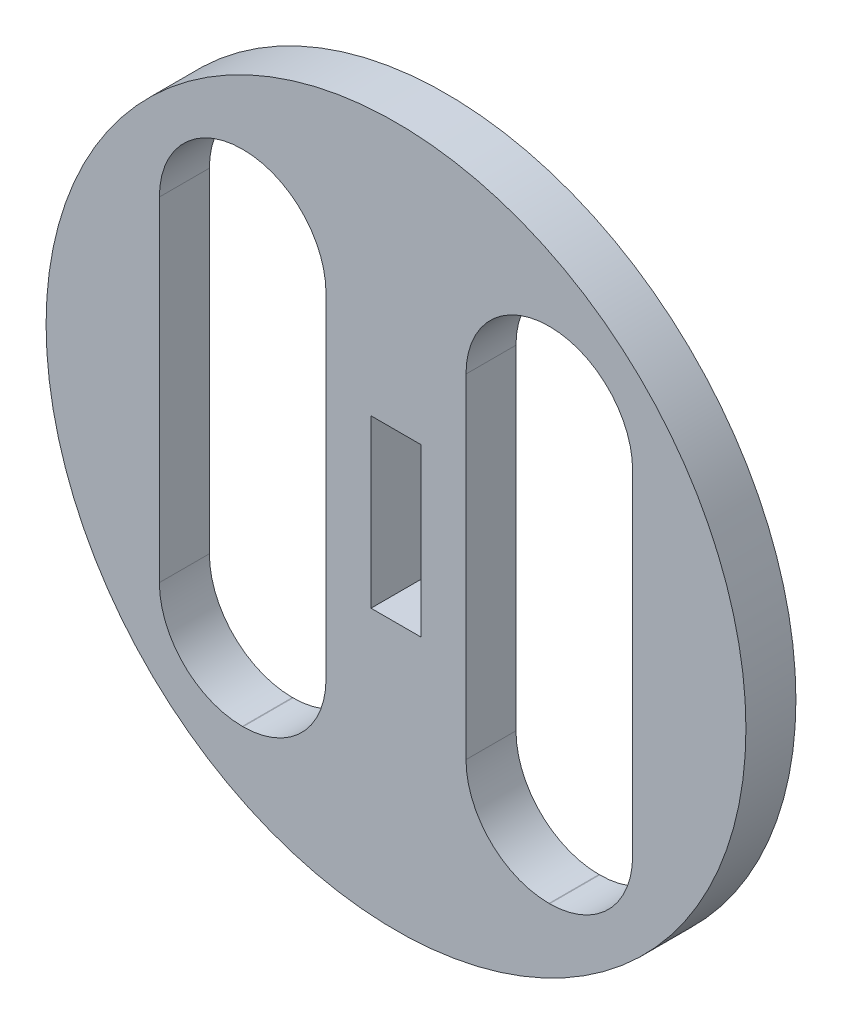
ISO-10303-21;
HEADER;
FILE_DESCRIPTION(('STEP AP214'),'2;1');
FILE_NAME('part.step','',(''),(''),'','','');
FILE_SCHEMA(('AUTOMOTIVE_DESIGN { 1 0 10303 214 1 1 1 1 }'));
ENDSEC;
DATA;
#1=APPLICATION_CONTEXT('core data for automotive mechanical design processes');
#2=APPLICATION_PROTOCOL_DEFINITION('international standard','automotive_design',2000,#1);
#3=PRODUCT_CONTEXT('',#1,'mechanical');
#4=PRODUCT('Part','Part','',(#3));
#5=PRODUCT_RELATED_PRODUCT_CATEGORY('part','',(#4));
#6=PRODUCT_DEFINITION_FORMATION('','',#4);
#7=PRODUCT_DEFINITION_CONTEXT('part definition',#1,'design');
#8=PRODUCT_DEFINITION('design','',#6,#7);
#9=PRODUCT_DEFINITION_SHAPE('','',#8);
#10=(LENGTH_UNIT() NAMED_UNIT(*) SI_UNIT(.MILLI.,.METRE.));
#11=(NAMED_UNIT(*) PLANE_ANGLE_UNIT() SI_UNIT($,.RADIAN.));
#12=(NAMED_UNIT(*) SI_UNIT($,.STERADIAN.) SOLID_ANGLE_UNIT());
#13=UNCERTAINTY_MEASURE_WITH_UNIT(LENGTH_MEASURE(1.E-05),#10,'distance_accuracy_value','');
#14=(GEOMETRIC_REPRESENTATION_CONTEXT(3) GLOBAL_UNCERTAINTY_ASSIGNED_CONTEXT((#13)) GLOBAL_UNIT_ASSIGNED_CONTEXT((#10,
#11,#12)) REPRESENTATION_CONTEXT('',''));
#15=CARTESIAN_POINT('',(0.,0.,0.));
#16=DIRECTION('',(0.,0.,1.));
#17=DIRECTION('',(1.,0.,0.));
#18=AXIS2_PLACEMENT_3D('',#15,#16,#17);
#19=CARTESIAN_POINT('',(0.,0.,3.81));
#20=DIRECTION('',(0.,0.,1.));
#21=DIRECTION('',(1.,0.,0.));
#22=AXIS2_PLACEMENT_3D('',#19,#20,#21);
#23=PLANE('',#22);
#24=DIRECTION('',(0.,-1.,0.));
#25=VECTOR('',#24,1.);
#26=CARTESIAN_POINT('',(5.334,12.7254,3.81));
#27=LINE('',#26,#25);
#28=CARTESIAN_POINT('',(5.334,12.7254,3.81));
#29=VERTEX_POINT('',#28);
#30=CARTESIAN_POINT('',(5.334,-12.7254,3.81));
#31=VERTEX_POINT('',#30);
#32=EDGE_CURVE('E229',#29,#31,#27,.T.);
#33=ORIENTED_EDGE('',*,*,#32,.F.);
#34=CARTESIAN_POINT('',(11.6586,12.7254,3.81));
#35=DIRECTION('',(0.,0.,1.));
#36=DIRECTION('',(-1.,0.,0.));
#37=AXIS2_PLACEMENT_3D('',#34,#35,#36);
#38=CIRCLE('',#37,6.3246);
#39=CARTESIAN_POINT('',(11.6586,19.05,3.81));
#40=VERTEX_POINT('',#39);
#41=EDGE_CURVE('E227',#40,#29,#38,.T.);
#42=ORIENTED_EDGE('',*,*,#41,.F.);
#43=DIRECTION('',(-1.,0.,0.));
#44=VECTOR('',#43,1.);
#45=CARTESIAN_POINT('',(11.6586,19.05,3.81));
#46=LINE('',#45,#44);
#47=CARTESIAN_POINT('',(11.7094,19.05,3.81));
#48=VERTEX_POINT('',#47);
#49=EDGE_CURVE('E242',#48,#40,#46,.T.);
#50=ORIENTED_EDGE('',*,*,#49,.F.);
#51=CARTESIAN_POINT('',(11.7094,12.7254,3.81));
#52=DIRECTION('',(0.,0.,1.));
#53=DIRECTION('',(1.,0.,0.));
#54=AXIS2_PLACEMENT_3D('',#51,#52,#53);
#55=CIRCLE('',#54,6.3246);
#56=CARTESIAN_POINT('',(18.034,12.7254,3.81));
#57=VERTEX_POINT('',#56);
#58=EDGE_CURVE('E239',#57,#48,#55,.T.);
#59=ORIENTED_EDGE('',*,*,#58,.F.);
#60=DIRECTION('',(0.,1.,0.));
#61=VECTOR('',#60,1.);
#62=CARTESIAN_POINT('',(18.034,12.7254,3.81));
#63=LINE('',#62,#61);
#64=CARTESIAN_POINT('',(18.034,-12.7254,3.81));
#65=VERTEX_POINT('',#64);
#66=EDGE_CURVE('E237',#65,#57,#63,.T.);
#67=ORIENTED_EDGE('',*,*,#66,.F.);
#68=CARTESIAN_POINT('',(11.7094,-12.7254,3.81));
#69=DIRECTION('',(0.,0.,1.));
#70=DIRECTION('',(1.,0.,0.));
#71=AXIS2_PLACEMENT_3D('',#68,#69,#70);
#72=CIRCLE('',#71,6.3246);
#73=CARTESIAN_POINT('',(11.7094,-19.05,3.81));
#74=VERTEX_POINT('',#73);
#75=EDGE_CURVE('E235',#74,#65,#72,.T.);
#76=ORIENTED_EDGE('',*,*,#75,.F.);
#77=DIRECTION('',(1.,0.,0.));
#78=VECTOR('',#77,1.);
#79=CARTESIAN_POINT('',(11.6586,-19.05,3.81));
#80=LINE('',#79,#78);
#81=CARTESIAN_POINT('',(11.6586,-19.05,3.81));
#82=VERTEX_POINT('',#81);
#83=EDGE_CURVE('E233',#82,#74,#80,.T.);
#84=ORIENTED_EDGE('',*,*,#83,.F.);
#85=CARTESIAN_POINT('',(11.6586,-12.7254,3.81));
#86=DIRECTION('',(0.,0.,1.));
#87=DIRECTION('',(1.,0.,0.));
#88=AXIS2_PLACEMENT_3D('',#85,#86,#87);
#89=CIRCLE('',#88,6.3246);
#90=EDGE_CURVE('E231',#31,#82,#89,.T.);
#91=ORIENTED_EDGE('',*,*,#90,.F.);
#92=EDGE_LOOP('',(#33,#42,#50,#59,#67,#76,#84,#91));
#93=FACE_BOUND('',#92,.T.);
#94=CARTESIAN_POINT('',(0.,0.,3.81));
#95=DIRECTION('',(0.,0.,1.));
#96=DIRECTION('',(1.,0.,0.));
#97=AXIS2_PLACEMENT_3D('',#94,#95,#96);
#98=CIRCLE('',#97,26.67);
#99=CARTESIAN_POINT('',(-26.67,0.,3.81));
#100=VERTEX_POINT('',#99);
#101=EDGE_CURVE('E11',#100,#100,#98,.T.);
#102=ORIENTED_EDGE('',*,*,#101,.T.);
#103=EDGE_LOOP('',(#102));
#104=FACE_BOUND('',#103,.T.);
#105=DIRECTION('',(0.,-1.,0.));
#106=VECTOR('',#105,1.);
#107=CARTESIAN_POINT('',(-18.034,12.7254,3.81));
#108=LINE('',#107,#106);
#109=CARTESIAN_POINT('',(-18.034,12.7254,3.81));
#110=VERTEX_POINT('',#109);
#111=CARTESIAN_POINT('',(-18.034,-12.7254,3.81));
#112=VERTEX_POINT('',#111);
#113=EDGE_CURVE('E288',#110,#112,#108,.T.);
#114=ORIENTED_EDGE('',*,*,#113,.F.);
#115=CARTESIAN_POINT('',(-11.7094,12.7254,3.81));
#116=DIRECTION('',(0.,0.,1.));
#117=DIRECTION('',(-1.,0.,0.));
#118=AXIS2_PLACEMENT_3D('',#115,#116,#117);
#119=CIRCLE('',#118,6.3246);
#120=CARTESIAN_POINT('',(-11.7094,19.05,3.81));
#121=VERTEX_POINT('',#120);
#122=EDGE_CURVE('E286',#121,#110,#119,.T.);
#123=ORIENTED_EDGE('',*,*,#122,.F.);
#124=DIRECTION('',(-1.,0.,0.));
#125=VECTOR('',#124,1.);
#126=CARTESIAN_POINT('',(-11.7094,19.05,3.81));
#127=LINE('',#126,#125);
#128=CARTESIAN_POINT('',(-11.6586,19.05,3.81));
#129=VERTEX_POINT('',#128);
#130=EDGE_CURVE('E301',#129,#121,#127,.T.);
#131=ORIENTED_EDGE('',*,*,#130,.F.);
#132=CARTESIAN_POINT('',(-11.6586,12.7254,3.81));
#133=DIRECTION('',(0.,0.,1.));
#134=DIRECTION('',(1.,0.,0.));
#135=AXIS2_PLACEMENT_3D('',#132,#133,#134);
#136=CIRCLE('',#135,6.3246);
#137=CARTESIAN_POINT('',(-5.334,12.7254,3.81));
#138=VERTEX_POINT('',#137);
#139=EDGE_CURVE('E298',#138,#129,#136,.T.);
#140=ORIENTED_EDGE('',*,*,#139,.F.);
#141=DIRECTION('',(0.,1.,0.));
#142=VECTOR('',#141,1.);
#143=CARTESIAN_POINT('',(-5.334,12.7254,3.81));
#144=LINE('',#143,#142);
#145=CARTESIAN_POINT('',(-5.334,-12.7254,3.81));
#146=VERTEX_POINT('',#145);
#147=EDGE_CURVE('E296',#146,#138,#144,.T.);
#148=ORIENTED_EDGE('',*,*,#147,.F.);
#149=CARTESIAN_POINT('',(-11.6586,-12.7254,3.81));
#150=DIRECTION('',(0.,0.,1.));
#151=DIRECTION('',(1.,0.,0.));
#152=AXIS2_PLACEMENT_3D('',#149,#150,#151);
#153=CIRCLE('',#152,6.3246);
#154=CARTESIAN_POINT('',(-11.6586,-19.05,3.81));
#155=VERTEX_POINT('',#154);
#156=EDGE_CURVE('E294',#155,#146,#153,.T.);
#157=ORIENTED_EDGE('',*,*,#156,.F.);
#158=DIRECTION('',(1.,0.,0.));
#159=VECTOR('',#158,1.);
#160=CARTESIAN_POINT('',(-11.7094,-19.05,3.81));
#161=LINE('',#160,#159);
#162=CARTESIAN_POINT('',(-11.7094,-19.05,3.81));
#163=VERTEX_POINT('',#162);
#164=EDGE_CURVE('E292',#163,#155,#161,.T.);
#165=ORIENTED_EDGE('',*,*,#164,.F.);
#166=CARTESIAN_POINT('',(-11.7094,-12.7254,3.81));
#167=DIRECTION('',(0.,0.,1.));
#168=DIRECTION('',(-1.,0.,0.));
#169=AXIS2_PLACEMENT_3D('',#166,#167,#168);
#170=CIRCLE('',#169,6.3246);
#171=EDGE_CURVE('E290',#112,#163,#170,.T.);
#172=ORIENTED_EDGE('',*,*,#171,.F.);
#173=EDGE_LOOP('',(#114,#123,#131,#140,#148,#157,#165,#172));
#174=FACE_BOUND('',#173,.T.);
#175=DIRECTION('',(1.,0.,0.));
#176=VECTOR('',#175,1.);
#177=CARTESIAN_POINT('',(-1.905,-6.35,3.81));
#178=LINE('',#177,#176);
#179=CARTESIAN_POINT('',(-1.905,-6.35,3.81));
#180=VERTEX_POINT('',#179);
#181=CARTESIAN_POINT('',(1.905,-6.35,3.81));
#182=VERTEX_POINT('',#181);
#183=EDGE_CURVE('E194',#180,#182,#178,.T.);
#184=ORIENTED_EDGE('',*,*,#183,.F.);
#185=DIRECTION('',(0.,-1.,0.));
#186=VECTOR('',#185,1.);
#187=CARTESIAN_POINT('',(-1.905,6.35,3.81));
#188=LINE('',#187,#186);
#189=CARTESIAN_POINT('',(-1.905,6.35,3.81));
#190=VERTEX_POINT('',#189);
#191=EDGE_CURVE('E183',#190,#180,#188,.T.);
#192=ORIENTED_EDGE('',*,*,#191,.F.);
#193=DIRECTION('',(-1.,0.,0.));
#194=VECTOR('',#193,1.);
#195=CARTESIAN_POINT('',(-1.905,6.35,3.81));
#196=LINE('',#195,#194);
#197=CARTESIAN_POINT('',(1.905,6.35,3.81));
#198=VERTEX_POINT('',#197);
#199=EDGE_CURVE('E198',#198,#190,#196,.T.);
#200=ORIENTED_EDGE('',*,*,#199,.F.);
#201=DIRECTION('',(0.,1.,0.));
#202=VECTOR('',#201,1.);
#203=CARTESIAN_POINT('',(1.905,6.35,3.81));
#204=LINE('',#203,#202);
#205=EDGE_CURVE('E196',#182,#198,#204,.T.);
#206=ORIENTED_EDGE('',*,*,#205,.F.);
#207=EDGE_LOOP('',(#184,#192,#200,#206));
#208=FACE_BOUND('',#207,.T.);
#209=ADVANCED_FACE('F31',(#93,#104,#174,#208),#23,.T.);
#210=CARTESIAN_POINT('',(0.,0.,0.));
#211=DIRECTION('',(0.,0.,1.));
#212=DIRECTION('',(1.,0.,0.));
#213=AXIS2_PLACEMENT_3D('',#210,#211,#212);
#214=PLANE('',#213);
#215=CARTESIAN_POINT('',(11.6586,12.7254,0.));
#216=DIRECTION('',(0.,0.,1.));
#217=DIRECTION('',(-1.,0.,0.));
#218=AXIS2_PLACEMENT_3D('',#215,#216,#217);
#219=CIRCLE('',#218,6.3246);
#220=CARTESIAN_POINT('',(11.6586,19.05,0.));
#221=VERTEX_POINT('',#220);
#222=CARTESIAN_POINT('',(5.334,12.7254,0.));
#223=VERTEX_POINT('',#222);
#224=EDGE_CURVE('E184',#221,#223,#219,.T.);
#225=ORIENTED_EDGE('',*,*,#224,.T.);
#226=DIRECTION('',(0.,-1.,0.));
#227=VECTOR('',#226,1.);
#228=CARTESIAN_POINT('',(5.334,12.7254,0.));
#229=LINE('',#228,#227);
#230=CARTESIAN_POINT('',(5.334,-12.7254,0.));
#231=VERTEX_POINT('',#230);
#232=EDGE_CURVE('E206',#223,#231,#229,.T.);
#233=ORIENTED_EDGE('',*,*,#232,.T.);
#234=CARTESIAN_POINT('',(11.6586,-12.7254,0.));
#235=DIRECTION('',(0.,0.,1.));
#236=DIRECTION('',(1.,0.,0.));
#237=AXIS2_PLACEMENT_3D('',#234,#235,#236);
#238=CIRCLE('',#237,6.3246);
#239=CARTESIAN_POINT('',(11.6586,-19.05,0.));
#240=VERTEX_POINT('',#239);
#241=EDGE_CURVE('E209',#231,#240,#238,.T.);
#242=ORIENTED_EDGE('',*,*,#241,.T.);
#243=DIRECTION('',(1.,0.,0.));
#244=VECTOR('',#243,1.);
#245=CARTESIAN_POINT('',(11.6586,-19.05,0.));
#246=LINE('',#245,#244);
#247=CARTESIAN_POINT('',(11.7094,-19.05,0.));
#248=VERTEX_POINT('',#247);
#249=EDGE_CURVE('E212',#240,#248,#246,.T.);
#250=ORIENTED_EDGE('',*,*,#249,.T.);
#251=CARTESIAN_POINT('',(11.7094,-12.7254,0.));
#252=DIRECTION('',(0.,0.,1.));
#253=DIRECTION('',(1.,0.,0.));
#254=AXIS2_PLACEMENT_3D('',#251,#252,#253);
#255=CIRCLE('',#254,6.3246);
#256=CARTESIAN_POINT('',(18.034,-12.7254,0.));
#257=VERTEX_POINT('',#256);
#258=EDGE_CURVE('E215',#248,#257,#255,.T.);
#259=ORIENTED_EDGE('',*,*,#258,.T.);
#260=DIRECTION('',(0.,1.,0.));
#261=VECTOR('',#260,1.);
#262=CARTESIAN_POINT('',(18.034,12.7254,0.));
#263=LINE('',#262,#261);
#264=CARTESIAN_POINT('',(18.034,12.7254,0.));
#265=VERTEX_POINT('',#264);
#266=EDGE_CURVE('E218',#257,#265,#263,.T.);
#267=ORIENTED_EDGE('',*,*,#266,.T.);
#268=CARTESIAN_POINT('',(11.7094,12.7254,0.));
#269=DIRECTION('',(0.,0.,1.));
#270=DIRECTION('',(1.,0.,0.));
#271=AXIS2_PLACEMENT_3D('',#268,#269,#270);
#272=CIRCLE('',#271,6.3246);
#273=CARTESIAN_POINT('',(11.7094,19.05,0.));
#274=VERTEX_POINT('',#273);
#275=EDGE_CURVE('E221',#265,#274,#272,.T.);
#276=ORIENTED_EDGE('',*,*,#275,.T.);
#277=DIRECTION('',(-1.,0.,0.));
#278=VECTOR('',#277,1.);
#279=CARTESIAN_POINT('',(11.6586,19.05,0.));
#280=LINE('',#279,#278);
#281=EDGE_CURVE('E224',#274,#221,#280,.T.);
#282=ORIENTED_EDGE('',*,*,#281,.T.);
#283=EDGE_LOOP('',(#225,#233,#242,#250,#259,#267,#276,#282));
#284=FACE_BOUND('',#283,.T.);
#285=CARTESIAN_POINT('',(0.,0.,0.));
#286=DIRECTION('',(0.,0.,1.));
#287=DIRECTION('',(1.,0.,0.));
#288=AXIS2_PLACEMENT_3D('',#285,#286,#287);
#289=CIRCLE('',#288,26.67);
#290=CARTESIAN_POINT('',(-26.67,0.,0.));
#291=VERTEX_POINT('',#290);
#292=EDGE_CURVE('E39',#291,#291,#289,.T.);
#293=ORIENTED_EDGE('',*,*,#292,.F.);
#294=EDGE_LOOP('',(#293));
#295=FACE_BOUND('',#294,.T.);
#296=CARTESIAN_POINT('',(-11.7094,12.7254,0.));
#297=DIRECTION('',(0.,0.,1.));
#298=DIRECTION('',(-1.,0.,0.));
#299=AXIS2_PLACEMENT_3D('',#296,#297,#298);
#300=CIRCLE('',#299,6.3246);
#301=CARTESIAN_POINT('',(-11.7094,19.05,0.));
#302=VERTEX_POINT('',#301);
#303=CARTESIAN_POINT('',(-18.034,12.7254,0.));
#304=VERTEX_POINT('',#303);
#305=EDGE_CURVE('E262',#302,#304,#300,.T.);
#306=ORIENTED_EDGE('',*,*,#305,.T.);
#307=DIRECTION('',(0.,-1.,0.));
#308=VECTOR('',#307,1.);
#309=CARTESIAN_POINT('',(-18.034,12.7254,0.));
#310=LINE('',#309,#308);
#311=CARTESIAN_POINT('',(-18.034,-12.7254,0.));
#312=VERTEX_POINT('',#311);
#313=EDGE_CURVE('E265',#304,#312,#310,.T.);
#314=ORIENTED_EDGE('',*,*,#313,.T.);
#315=CARTESIAN_POINT('',(-11.7094,-12.7254,0.));
#316=DIRECTION('',(0.,0.,1.));
#317=DIRECTION('',(-1.,0.,0.));
#318=AXIS2_PLACEMENT_3D('',#315,#316,#317);
#319=CIRCLE('',#318,6.3246);
#320=CARTESIAN_POINT('',(-11.7094,-19.05,0.));
#321=VERTEX_POINT('',#320);
#322=EDGE_CURVE('E268',#312,#321,#319,.T.);
#323=ORIENTED_EDGE('',*,*,#322,.T.);
#324=DIRECTION('',(1.,0.,0.));
#325=VECTOR('',#324,1.);
#326=CARTESIAN_POINT('',(-11.7094,-19.05,0.));
#327=LINE('',#326,#325);
#328=CARTESIAN_POINT('',(-11.6586,-19.05,0.));
#329=VERTEX_POINT('',#328);
#330=EDGE_CURVE('E271',#321,#329,#327,.T.);
#331=ORIENTED_EDGE('',*,*,#330,.T.);
#332=CARTESIAN_POINT('',(-11.6586,-12.7254,0.));
#333=DIRECTION('',(0.,0.,1.));
#334=DIRECTION('',(1.,0.,0.));
#335=AXIS2_PLACEMENT_3D('',#332,#333,#334);
#336=CIRCLE('',#335,6.3246);
#337=CARTESIAN_POINT('',(-5.334,-12.7254,0.));
#338=VERTEX_POINT('',#337);
#339=EDGE_CURVE('E274',#329,#338,#336,.T.);
#340=ORIENTED_EDGE('',*,*,#339,.T.);
#341=DIRECTION('',(0.,1.,0.));
#342=VECTOR('',#341,1.);
#343=CARTESIAN_POINT('',(-5.334,12.7254,0.));
#344=LINE('',#343,#342);
#345=CARTESIAN_POINT('',(-5.334,12.7254,0.));
#346=VERTEX_POINT('',#345);
#347=EDGE_CURVE('E277',#338,#346,#344,.T.);
#348=ORIENTED_EDGE('',*,*,#347,.T.);
#349=CARTESIAN_POINT('',(-11.6586,12.7254,0.));
#350=DIRECTION('',(0.,0.,1.));
#351=DIRECTION('',(1.,0.,0.));
#352=AXIS2_PLACEMENT_3D('',#349,#350,#351);
#353=CIRCLE('',#352,6.3246);
#354=CARTESIAN_POINT('',(-11.6586,19.05,0.));
#355=VERTEX_POINT('',#354);
#356=EDGE_CURVE('E280',#346,#355,#353,.T.);
#357=ORIENTED_EDGE('',*,*,#356,.T.);
#358=DIRECTION('',(-1.,0.,0.));
#359=VECTOR('',#358,1.);
#360=CARTESIAN_POINT('',(-11.7094,19.05,0.));
#361=LINE('',#360,#359);
#362=EDGE_CURVE('E283',#355,#302,#361,.T.);
#363=ORIENTED_EDGE('',*,*,#362,.T.);
#364=EDGE_LOOP('',(#306,#314,#323,#331,#340,#348,#357,#363));
#365=FACE_BOUND('',#364,.T.);
#366=DIRECTION('',(0.,-1.,0.));
#367=VECTOR('',#366,1.);
#368=CARTESIAN_POINT('',(-1.905,6.35,0.));
#369=LINE('',#368,#367);
#370=CARTESIAN_POINT('',(-1.905,6.35,0.));
#371=VERTEX_POINT('',#370);
#372=CARTESIAN_POINT('',(-1.905,-6.35,0.));
#373=VERTEX_POINT('',#372);
#374=EDGE_CURVE('E54',#371,#373,#369,.T.);
#375=ORIENTED_EDGE('',*,*,#374,.T.);
#376=DIRECTION('',(1.,0.,0.));
#377=VECTOR('',#376,1.);
#378=CARTESIAN_POINT('',(-1.905,-6.35,0.));
#379=LINE('',#378,#377);
#380=CARTESIAN_POINT('',(1.905,-6.35,0.));
#381=VERTEX_POINT('',#380);
#382=EDGE_CURVE('E170',#373,#381,#379,.T.);
#383=ORIENTED_EDGE('',*,*,#382,.T.);
#384=DIRECTION('',(0.,1.,0.));
#385=VECTOR('',#384,1.);
#386=CARTESIAN_POINT('',(1.905,6.35,0.));
#387=LINE('',#386,#385);
#388=CARTESIAN_POINT('',(1.905,6.35,0.));
#389=VERTEX_POINT('',#388);
#390=EDGE_CURVE('E179',#381,#389,#387,.T.);
#391=ORIENTED_EDGE('',*,*,#390,.T.);
#392=DIRECTION('',(-1.,0.,0.));
#393=VECTOR('',#392,1.);
#394=CARTESIAN_POINT('',(-1.905,6.35,0.));
#395=LINE('',#394,#393);
#396=EDGE_CURVE('E188',#389,#371,#395,.T.);
#397=ORIENTED_EDGE('',*,*,#396,.T.);
#398=EDGE_LOOP('',(#375,#383,#391,#397));
#399=FACE_BOUND('',#398,.T.);
#400=ADVANCED_FACE('F187',(#284,#295,#365,#399),#214,.F.);
#401=CARTESIAN_POINT('',(0.,0.,3.81));
#402=DIRECTION('',(0.,0.,-1.));
#403=DIRECTION('',(-1.,0.,0.));
#404=AXIS2_PLACEMENT_3D('',#401,#402,#403);
#405=CYLINDRICAL_SURFACE('',#404,26.67);
#406=CARTESIAN_POINT('',(-26.67,0.,3.81));
#407=CARTESIAN_POINT('',(-26.67,0.,3.7703125));
#408=CARTESIAN_POINT('',(-26.67,0.,3.730625));
#409=CARTESIAN_POINT('',(-26.67,0.,3.65125));
#410=CARTESIAN_POINT('',(-26.67,0.,3.6115625));
#411=CARTESIAN_POINT('',(-26.67,0.,3.5321875));
#412=CARTESIAN_POINT('',(-26.67,0.,3.4925));
#413=CARTESIAN_POINT('',(-26.67,0.,3.413125));
#414=CARTESIAN_POINT('',(-26.67,0.,3.3734375));
#415=CARTESIAN_POINT('',(-26.67,0.,3.2940625));
#416=CARTESIAN_POINT('',(-26.67,0.,3.254375));
#417=CARTESIAN_POINT('',(-26.67,0.,3.175));
#418=CARTESIAN_POINT('',(-26.67,0.,3.1353125));
#419=CARTESIAN_POINT('',(-26.67,0.,3.0559375));
#420=CARTESIAN_POINT('',(-26.67,0.,3.01625));
#421=CARTESIAN_POINT('',(-26.67,0.,2.936875));
#422=CARTESIAN_POINT('',(-26.67,0.,2.8971875));
#423=CARTESIAN_POINT('',(-26.67,0.,2.8178125));
#424=CARTESIAN_POINT('',(-26.67,0.,2.778125));
#425=CARTESIAN_POINT('',(-26.67,0.,2.69875));
#426=CARTESIAN_POINT('',(-26.67,0.,2.6590625));
#427=CARTESIAN_POINT('',(-26.67,0.,2.5796875));
#428=CARTESIAN_POINT('',(-26.67,0.,2.54));
#429=CARTESIAN_POINT('',(-26.67,0.,2.460625));
#430=CARTESIAN_POINT('',(-26.67,0.,2.4209375));
#431=CARTESIAN_POINT('',(-26.67,0.,2.3415625));
#432=CARTESIAN_POINT('',(-26.67,0.,2.301875));
#433=CARTESIAN_POINT('',(-26.67,0.,2.2225));
#434=CARTESIAN_POINT('',(-26.67,0.,2.1828125));
#435=CARTESIAN_POINT('',(-26.67,0.,2.1034375));
#436=CARTESIAN_POINT('',(-26.67,0.,2.06375));
#437=CARTESIAN_POINT('',(-26.67,0.,1.984375));
#438=CARTESIAN_POINT('',(-26.67,0.,1.9446875));
#439=CARTESIAN_POINT('',(-26.67,0.,1.8653125));
#440=CARTESIAN_POINT('',(-26.67,0.,1.825625));
#441=CARTESIAN_POINT('',(-26.67,0.,1.74625));
#442=CARTESIAN_POINT('',(-26.67,0.,1.7065625));
#443=CARTESIAN_POINT('',(-26.67,0.,1.6271875));
#444=CARTESIAN_POINT('',(-26.67,0.,1.5875));
#445=CARTESIAN_POINT('',(-26.67,0.,1.508125));
#446=CARTESIAN_POINT('',(-26.67,0.,1.4684375));
#447=CARTESIAN_POINT('',(-26.67,0.,1.3890625));
#448=CARTESIAN_POINT('',(-26.67,0.,1.349375));
#449=CARTESIAN_POINT('',(-26.67,0.,1.27));
#450=CARTESIAN_POINT('',(-26.67,0.,1.2303125));
#451=CARTESIAN_POINT('',(-26.67,0.,1.1509375));
#452=CARTESIAN_POINT('',(-26.67,0.,1.11125));
#453=CARTESIAN_POINT('',(-26.67,0.,1.031875));
#454=CARTESIAN_POINT('',(-26.67,0.,0.9921875));
#455=CARTESIAN_POINT('',(-26.67,0.,0.9128125));
#456=CARTESIAN_POINT('',(-26.67,0.,0.873125));
#457=CARTESIAN_POINT('',(-26.67,0.,0.79375));
#458=CARTESIAN_POINT('',(-26.67,0.,0.7540625));
#459=CARTESIAN_POINT('',(-26.67,0.,0.6746875));
#460=CARTESIAN_POINT('',(-26.67,0.,0.635));
#461=CARTESIAN_POINT('',(-26.67,0.,0.555625));
#462=CARTESIAN_POINT('',(-26.67,0.,0.5159375));
#463=CARTESIAN_POINT('',(-26.67,0.,0.4365625));
#464=CARTESIAN_POINT('',(-26.67,0.,0.396875));
#465=CARTESIAN_POINT('',(-26.67,0.,0.3175));
#466=CARTESIAN_POINT('',(-26.67,0.,0.2778125));
#467=CARTESIAN_POINT('',(-26.67,0.,0.1984375));
#468=CARTESIAN_POINT('',(-26.67,0.,0.15875));
#469=CARTESIAN_POINT('',(-26.67,0.,0.0793749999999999));
#470=CARTESIAN_POINT('',(-26.67,0.,0.0396874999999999));
#471=CARTESIAN_POINT('',(-26.67,0.,0.));
#472=B_SPLINE_CURVE_WITH_KNOTS('',3,(#406,#407,#408,#409,#410,#411,#412,#413,#414,#415,#416,
#417,#418,#419,#420,#421,#422,#423,#424,#425,#426,#427,#428,#429,#430,#431,#432,#433,#434,#435,
#436,#437,#438,#439,#440,#441,#442,#443,#444,#445,#446,#447,#448,#449,#450,#451,#452,#453,#454,
#455,#456,#457,#458,#459,#460,#461,#462,#463,#464,#465,#466,#467,#468,#469,#470,#471),
.UNSPECIFIED.,.F.,.F.,(4,2,2,2,2,2,2,2,2,2,2,2,2,2,2,2,2,2,2,2,2,2,2,2,2,2,2,2,2,2,2,2,4),(0.,
0.1190625,0.238125,0.3571875,0.47625,0.5953125,0.714375,0.8334375,0.9525,1.0715625,1.190625,
1.3096875,1.42875,1.5478125,1.666875,1.7859375,1.905,2.0240625,2.143125,2.2621875,2.38125,
2.5003125,2.619375,2.7384375,2.8575,2.9765625,3.095625,3.2146875,3.33375,3.4528125,3.571875,
3.6909375,3.81),.UNSPECIFIED.);
#473=EDGE_CURVE('BSEAM33',#100,#291,#472,.T.);
#474=ORIENTED_EDGE('',*,*,#101,.F.);
#475=ORIENTED_EDGE('',*,*,#292,.T.);
#476=ORIENTED_EDGE('',*,*,#473,.T.);
#477=ORIENTED_EDGE('',*,*,#473,.F.);
#478=EDGE_LOOP('',(#474,#476,#475,#477));
#479=FACE_BOUND('',#478,.T.);
#480=ADVANCED_FACE('F33',(#479),#405,.T.);
#481=CARTESIAN_POINT('',(-11.7094,12.7254,3.81));
#482=DIRECTION('',(0.,0.,-1.));
#483=DIRECTION('',(-1.,0.,0.));
#484=AXIS2_PLACEMENT_3D('',#481,#482,#483);
#485=CYLINDRICAL_SURFACE('',#484,6.3246);
#486=ORIENTED_EDGE('',*,*,#305,.F.);
#487=DIRECTION('',(0.,0.,-1.));
#488=VECTOR('',#487,1.);
#489=CARTESIAN_POINT('',(-11.7094,19.05,3.81));
#490=LINE('',#489,#488);
#491=EDGE_CURVE('E303',#121,#302,#490,.T.);
#492=ORIENTED_EDGE('',*,*,#491,.F.);
#493=ORIENTED_EDGE('',*,*,#122,.T.);
#494=DIRECTION('',(0.,0.,-1.));
#495=VECTOR('',#494,1.);
#496=CARTESIAN_POINT('',(-18.034,12.7254,3.81));
#497=LINE('',#496,#495);
#498=EDGE_CURVE('E318',#110,#304,#497,.T.);
#499=ORIENTED_EDGE('',*,*,#498,.T.);
#500=EDGE_LOOP('',(#486,#492,#493,#499));
#501=FACE_BOUND('',#500,.T.);
#502=ADVANCED_FACE('F331',(#501),#485,.F.);
#503=CARTESIAN_POINT('',(-18.034,12.7254,3.81));
#504=DIRECTION('',(1.,0.,0.));
#505=DIRECTION('',(0.,1.,0.));
#506=AXIS2_PLACEMENT_3D('',#503,#504,#505);
#507=PLANE('',#506);
#508=ORIENTED_EDGE('',*,*,#313,.F.);
#509=ORIENTED_EDGE('',*,*,#498,.F.);
#510=ORIENTED_EDGE('',*,*,#113,.T.);
#511=DIRECTION('',(0.,0.,-1.));
#512=VECTOR('',#511,1.);
#513=CARTESIAN_POINT('',(-18.034,-12.7254,3.81));
#514=LINE('',#513,#512);
#515=EDGE_CURVE('E316',#112,#312,#514,.T.);
#516=ORIENTED_EDGE('',*,*,#515,.T.);
#517=EDGE_LOOP('',(#508,#509,#510,#516));
#518=FACE_BOUND('',#517,.T.);
#519=ADVANCED_FACE('F344',(#518),#507,.T.);
#520=CARTESIAN_POINT('',(-11.7094,-12.7254,3.81));
#521=DIRECTION('',(0.,0.,-1.));
#522=DIRECTION('',(-1.,0.,0.));
#523=AXIS2_PLACEMENT_3D('',#520,#521,#522);
#524=CYLINDRICAL_SURFACE('',#523,6.3246);
#525=ORIENTED_EDGE('',*,*,#322,.F.);
#526=ORIENTED_EDGE('',*,*,#515,.F.);
#527=ORIENTED_EDGE('',*,*,#171,.T.);
#528=DIRECTION('',(0.,0.,-1.));
#529=VECTOR('',#528,1.);
#530=CARTESIAN_POINT('',(-11.7094,-19.05,3.81));
#531=LINE('',#530,#529);
#532=EDGE_CURVE('E314',#163,#321,#531,.T.);
#533=ORIENTED_EDGE('',*,*,#532,.T.);
#534=EDGE_LOOP('',(#525,#526,#527,#533));
#535=FACE_BOUND('',#534,.T.);
#536=ADVANCED_FACE('F348',(#535),#524,.F.);
#537=CARTESIAN_POINT('',(-11.7094,-19.05,3.81));
#538=DIRECTION('',(0.,1.,0.));
#539=DIRECTION('',(0.,0.,1.));
#540=AXIS2_PLACEMENT_3D('',#537,#538,#539);
#541=PLANE('',#540);
#542=ORIENTED_EDGE('',*,*,#330,.F.);
#543=ORIENTED_EDGE('',*,*,#532,.F.);
#544=ORIENTED_EDGE('',*,*,#164,.T.);
#545=DIRECTION('',(0.,0.,-1.));
#546=VECTOR('',#545,1.);
#547=CARTESIAN_POINT('',(-11.6586,-19.05,3.81));
#548=LINE('',#547,#546);
#549=EDGE_CURVE('E312',#155,#329,#548,.T.);
#550=ORIENTED_EDGE('',*,*,#549,.T.);
#551=EDGE_LOOP('',(#542,#543,#544,#550));
#552=FACE_BOUND('',#551,.T.);
#553=ADVANCED_FACE('F353',(#552),#541,.T.);
#554=CARTESIAN_POINT('',(-11.6586,-12.7254,3.81));
#555=DIRECTION('',(0.,0.,-1.));
#556=DIRECTION('',(-1.,0.,0.));
#557=AXIS2_PLACEMENT_3D('',#554,#555,#556);
#558=CYLINDRICAL_SURFACE('',#557,6.3246);
#559=ORIENTED_EDGE('',*,*,#339,.F.);
#560=ORIENTED_EDGE('',*,*,#549,.F.);
#561=ORIENTED_EDGE('',*,*,#156,.T.);
#562=DIRECTION('',(0.,0.,-1.));
#563=VECTOR('',#562,1.);
#564=CARTESIAN_POINT('',(-5.334,-12.7254,3.81));
#565=LINE('',#564,#563);
#566=EDGE_CURVE('E310',#146,#338,#565,.T.);
#567=ORIENTED_EDGE('',*,*,#566,.T.);
#568=EDGE_LOOP('',(#559,#560,#561,#567));
#569=FACE_BOUND('',#568,.T.);
#570=ADVANCED_FACE('F358',(#569),#558,.F.);
#571=CARTESIAN_POINT('',(-5.334,12.7254,3.81));
#572=DIRECTION('',(-1.,0.,0.));
#573=DIRECTION('',(0.,-1.,0.));
#574=AXIS2_PLACEMENT_3D('',#571,#572,#573);
#575=PLANE('',#574);
#576=ORIENTED_EDGE('',*,*,#347,.F.);
#577=ORIENTED_EDGE('',*,*,#566,.F.);
#578=ORIENTED_EDGE('',*,*,#147,.T.);
#579=DIRECTION('',(0.,0.,-1.));
#580=VECTOR('',#579,1.);
#581=CARTESIAN_POINT('',(-5.334,12.7254,3.81));
#582=LINE('',#581,#580);
#583=EDGE_CURVE('E308',#138,#346,#582,.T.);
#584=ORIENTED_EDGE('',*,*,#583,.T.);
#585=EDGE_LOOP('',(#576,#577,#578,#584));
#586=FACE_BOUND('',#585,.T.);
#587=ADVANCED_FACE('F362',(#586),#575,.T.);
#588=CARTESIAN_POINT('',(-11.6586,12.7254,3.81));
#589=DIRECTION('',(0.,0.,-1.));
#590=DIRECTION('',(-1.,0.,0.));
#591=AXIS2_PLACEMENT_3D('',#588,#589,#590);
#592=CYLINDRICAL_SURFACE('',#591,6.3246);
#593=ORIENTED_EDGE('',*,*,#356,.F.);
#594=ORIENTED_EDGE('',*,*,#583,.F.);
#595=ORIENTED_EDGE('',*,*,#139,.T.);
#596=DIRECTION('',(0.,0.,-1.));
#597=VECTOR('',#596,1.);
#598=CARTESIAN_POINT('',(-11.6586,19.05,3.81));
#599=LINE('',#598,#597);
#600=EDGE_CURVE('E306',#129,#355,#599,.T.);
#601=ORIENTED_EDGE('',*,*,#600,.T.);
#602=EDGE_LOOP('',(#593,#594,#595,#601));
#603=FACE_BOUND('',#602,.T.);
#604=ADVANCED_FACE('F366',(#603),#592,.F.);
#605=CARTESIAN_POINT('',(-11.7094,19.05,3.81));
#606=DIRECTION('',(0.,-1.,0.));
#607=DIRECTION('',(0.,0.,-1.));
#608=AXIS2_PLACEMENT_3D('',#605,#606,#607);
#609=PLANE('',#608);
#610=ORIENTED_EDGE('',*,*,#362,.F.);
#611=ORIENTED_EDGE('',*,*,#600,.F.);
#612=ORIENTED_EDGE('',*,*,#130,.T.);
#613=ORIENTED_EDGE('',*,*,#491,.T.);
#614=EDGE_LOOP('',(#610,#611,#612,#613));
#615=FACE_BOUND('',#614,.T.);
#616=ADVANCED_FACE('F335',(#615),#609,.T.);
#617=CARTESIAN_POINT('',(11.6586,12.7254,3.81));
#618=DIRECTION('',(0.,0.,-1.));
#619=DIRECTION('',(-1.,0.,0.));
#620=AXIS2_PLACEMENT_3D('',#617,#618,#619);
#621=CYLINDRICAL_SURFACE('',#620,6.3246);
#622=ORIENTED_EDGE('',*,*,#224,.F.);
#623=DIRECTION('',(0.,0.,-1.));
#624=VECTOR('',#623,1.);
#625=CARTESIAN_POINT('',(11.6586,19.05,3.81));
#626=LINE('',#625,#624);
#627=EDGE_CURVE('E244',#40,#221,#626,.T.);
#628=ORIENTED_EDGE('',*,*,#627,.F.);
#629=ORIENTED_EDGE('',*,*,#41,.T.);
#630=DIRECTION('',(0.,0.,-1.));
#631=VECTOR('',#630,1.);
#632=CARTESIAN_POINT('',(5.334,12.7254,3.81));
#633=LINE('',#632,#631);
#634=EDGE_CURVE('E259',#29,#223,#633,.T.);
#635=ORIENTED_EDGE('',*,*,#634,.T.);
#636=EDGE_LOOP('',(#622,#628,#629,#635));
#637=FACE_BOUND('',#636,.T.);
#638=ADVANCED_FACE('F373',(#637),#621,.F.);
#639=CARTESIAN_POINT('',(5.334,12.7254,3.81));
#640=DIRECTION('',(1.,0.,0.));
#641=DIRECTION('',(0.,1.,0.));
#642=AXIS2_PLACEMENT_3D('',#639,#640,#641);
#643=PLANE('',#642);
#644=ORIENTED_EDGE('',*,*,#232,.F.);
#645=ORIENTED_EDGE('',*,*,#634,.F.);
#646=ORIENTED_EDGE('',*,*,#32,.T.);
#647=DIRECTION('',(0.,0.,-1.));
#648=VECTOR('',#647,1.);
#649=CARTESIAN_POINT('',(5.334,-12.7254,3.81));
#650=LINE('',#649,#648);
#651=EDGE_CURVE('E257',#31,#231,#650,.T.);
#652=ORIENTED_EDGE('',*,*,#651,.T.);
#653=EDGE_LOOP('',(#644,#645,#646,#652));
#654=FACE_BOUND('',#653,.T.);
#655=ADVANCED_FACE('F419',(#654),#643,.T.);
#656=CARTESIAN_POINT('',(11.6586,-12.7254,3.81));
#657=DIRECTION('',(0.,0.,-1.));
#658=DIRECTION('',(-1.,0.,0.));
#659=AXIS2_PLACEMENT_3D('',#656,#657,#658);
#660=CYLINDRICAL_SURFACE('',#659,6.3246);
#661=ORIENTED_EDGE('',*,*,#241,.F.);
#662=ORIENTED_EDGE('',*,*,#651,.F.);
#663=ORIENTED_EDGE('',*,*,#90,.T.);
#664=DIRECTION('',(0.,0.,-1.));
#665=VECTOR('',#664,1.);
#666=CARTESIAN_POINT('',(11.6586,-19.05,3.81));
#667=LINE('',#666,#665);
#668=EDGE_CURVE('E255',#82,#240,#667,.T.);
#669=ORIENTED_EDGE('',*,*,#668,.T.);
#670=EDGE_LOOP('',(#661,#662,#663,#669));
#671=FACE_BOUND('',#670,.T.);
#672=ADVANCED_FACE('F429',(#671),#660,.F.);
#673=CARTESIAN_POINT('',(11.6586,-19.05,3.81));
#674=DIRECTION('',(0.,1.,0.));
#675=DIRECTION('',(0.,0.,1.));
#676=AXIS2_PLACEMENT_3D('',#673,#674,#675);
#677=PLANE('',#676);
#678=ORIENTED_EDGE('',*,*,#249,.F.);
#679=ORIENTED_EDGE('',*,*,#668,.F.);
#680=ORIENTED_EDGE('',*,*,#83,.T.);
#681=DIRECTION('',(0.,0.,-1.));
#682=VECTOR('',#681,1.);
#683=CARTESIAN_POINT('',(11.7094,-19.05,3.81));
#684=LINE('',#683,#682);
#685=EDGE_CURVE('E253',#74,#248,#684,.T.);
#686=ORIENTED_EDGE('',*,*,#685,.T.);
#687=EDGE_LOOP('',(#678,#679,#680,#686));
#688=FACE_BOUND('',#687,.T.);
#689=ADVANCED_FACE('F439',(#688),#677,.T.);
#690=CARTESIAN_POINT('',(11.7094,-12.7254,3.81));
#691=DIRECTION('',(0.,0.,-1.));
#692=DIRECTION('',(-1.,0.,0.));
#693=AXIS2_PLACEMENT_3D('',#690,#691,#692);
#694=CYLINDRICAL_SURFACE('',#693,6.3246);
#695=ORIENTED_EDGE('',*,*,#258,.F.);
#696=ORIENTED_EDGE('',*,*,#685,.F.);
#697=ORIENTED_EDGE('',*,*,#75,.T.);
#698=DIRECTION('',(0.,0.,-1.));
#699=VECTOR('',#698,1.);
#700=CARTESIAN_POINT('',(18.034,-12.7254,3.81));
#701=LINE('',#700,#699);
#702=EDGE_CURVE('E251',#65,#257,#701,.T.);
#703=ORIENTED_EDGE('',*,*,#702,.T.);
#704=EDGE_LOOP('',(#695,#696,#697,#703));
#705=FACE_BOUND('',#704,.T.);
#706=ADVANCED_FACE('F449',(#705),#694,.F.);
#707=CARTESIAN_POINT('',(18.034,12.7254,3.81));
#708=DIRECTION('',(-1.,0.,0.));
#709=DIRECTION('',(0.,-1.,0.));
#710=AXIS2_PLACEMENT_3D('',#707,#708,#709);
#711=PLANE('',#710);
#712=ORIENTED_EDGE('',*,*,#266,.F.);
#713=ORIENTED_EDGE('',*,*,#702,.F.);
#714=ORIENTED_EDGE('',*,*,#66,.T.);
#715=DIRECTION('',(0.,0.,-1.));
#716=VECTOR('',#715,1.);
#717=CARTESIAN_POINT('',(18.034,12.7254,3.81));
#718=LINE('',#717,#716);
#719=EDGE_CURVE('E249',#57,#265,#718,.T.);
#720=ORIENTED_EDGE('',*,*,#719,.T.);
#721=EDGE_LOOP('',(#712,#713,#714,#720));
#722=FACE_BOUND('',#721,.T.);
#723=ADVANCED_FACE('F459',(#722),#711,.T.);
#724=CARTESIAN_POINT('',(11.7094,12.7254,3.81));
#725=DIRECTION('',(0.,0.,-1.));
#726=DIRECTION('',(-1.,0.,0.));
#727=AXIS2_PLACEMENT_3D('',#724,#725,#726);
#728=CYLINDRICAL_SURFACE('',#727,6.3246);
#729=ORIENTED_EDGE('',*,*,#275,.F.);
#730=ORIENTED_EDGE('',*,*,#719,.F.);
#731=ORIENTED_EDGE('',*,*,#58,.T.);
#732=DIRECTION('',(0.,0.,-1.));
#733=VECTOR('',#732,1.);
#734=CARTESIAN_POINT('',(11.7094,19.05,3.81));
#735=LINE('',#734,#733);
#736=EDGE_CURVE('E247',#48,#274,#735,.T.);
#737=ORIENTED_EDGE('',*,*,#736,.T.);
#738=EDGE_LOOP('',(#729,#730,#731,#737));
#739=FACE_BOUND('',#738,.T.);
#740=ADVANCED_FACE('F469',(#739),#728,.F.);
#741=CARTESIAN_POINT('',(11.6586,19.05,3.81));
#742=DIRECTION('',(0.,-1.,0.));
#743=DIRECTION('',(0.,0.,-1.));
#744=AXIS2_PLACEMENT_3D('',#741,#742,#743);
#745=PLANE('',#744);
#746=ORIENTED_EDGE('',*,*,#281,.F.);
#747=ORIENTED_EDGE('',*,*,#736,.F.);
#748=ORIENTED_EDGE('',*,*,#49,.T.);
#749=ORIENTED_EDGE('',*,*,#627,.T.);
#750=EDGE_LOOP('',(#746,#747,#748,#749));
#751=FACE_BOUND('',#750,.T.);
#752=ADVANCED_FACE('F479',(#751),#745,.T.);
#753=CARTESIAN_POINT('',(-1.905,6.35,3.81));
#754=DIRECTION('',(1.,0.,0.));
#755=DIRECTION('',(0.,1.,0.));
#756=AXIS2_PLACEMENT_3D('',#753,#754,#755);
#757=PLANE('',#756);
#758=ORIENTED_EDGE('',*,*,#374,.F.);
#759=DIRECTION('',(0.,0.,-1.));
#760=VECTOR('',#759,1.);
#761=CARTESIAN_POINT('',(-1.905,6.35,3.81));
#762=LINE('',#761,#760);
#763=EDGE_CURVE('E200',#190,#371,#762,.T.);
#764=ORIENTED_EDGE('',*,*,#763,.F.);
#765=ORIENTED_EDGE('',*,*,#191,.T.);
#766=DIRECTION('',(0.,0.,-1.));
#767=VECTOR('',#766,1.);
#768=CARTESIAN_POINT('',(-1.905,-6.35,3.81));
#769=LINE('',#768,#767);
#770=EDGE_CURVE('E172',#180,#373,#769,.T.);
#771=ORIENTED_EDGE('',*,*,#770,.T.);
#772=EDGE_LOOP('',(#758,#764,#765,#771));
#773=FACE_BOUND('',#772,.T.);
#774=ADVANCED_FACE('F181',(#773),#757,.T.);
#775=CARTESIAN_POINT('',(-1.905,-6.35,3.81));
#776=DIRECTION('',(0.,1.,0.));
#777=DIRECTION('',(0.,0.,1.));
#778=AXIS2_PLACEMENT_3D('',#775,#776,#777);
#779=PLANE('',#778);
#780=ORIENTED_EDGE('',*,*,#382,.F.);
#781=ORIENTED_EDGE('',*,*,#770,.F.);
#782=ORIENTED_EDGE('',*,*,#183,.T.);
#783=DIRECTION('',(0.,0.,-1.));
#784=VECTOR('',#783,1.);
#785=CARTESIAN_POINT('',(1.905,-6.35,3.81));
#786=LINE('',#785,#784);
#787=EDGE_CURVE('E175',#182,#381,#786,.T.);
#788=ORIENTED_EDGE('',*,*,#787,.T.);
#789=EDGE_LOOP('',(#780,#781,#782,#788));
#790=FACE_BOUND('',#789,.T.);
#791=ADVANCED_FACE('F171',(#790),#779,.T.);
#792=CARTESIAN_POINT('',(1.905,6.35,3.81));
#793=DIRECTION('',(-1.,0.,0.));
#794=DIRECTION('',(0.,-1.,0.));
#795=AXIS2_PLACEMENT_3D('',#792,#793,#794);
#796=PLANE('',#795);
#797=ORIENTED_EDGE('',*,*,#390,.F.);
#798=ORIENTED_EDGE('',*,*,#787,.F.);
#799=ORIENTED_EDGE('',*,*,#205,.T.);
#800=DIRECTION('',(0.,0.,-1.));
#801=VECTOR('',#800,1.);
#802=CARTESIAN_POINT('',(1.905,6.35,3.81));
#803=LINE('',#802,#801);
#804=EDGE_CURVE('E46',#198,#389,#803,.T.);
#805=ORIENTED_EDGE('',*,*,#804,.T.);
#806=EDGE_LOOP('',(#797,#798,#799,#805));
#807=FACE_BOUND('',#806,.T.);
#808=ADVANCED_FACE('F517',(#807),#796,.T.);
#809=CARTESIAN_POINT('',(-1.905,6.35,3.81));
#810=DIRECTION('',(0.,-1.,0.));
#811=DIRECTION('',(1.,0.,0.));
#812=AXIS2_PLACEMENT_3D('',#809,#810,#811);
#813=PLANE('',#812);
#814=ORIENTED_EDGE('',*,*,#396,.F.);
#815=ORIENTED_EDGE('',*,*,#804,.F.);
#816=ORIENTED_EDGE('',*,*,#199,.T.);
#817=ORIENTED_EDGE('',*,*,#763,.T.);
#818=EDGE_LOOP('',(#814,#815,#816,#817));
#819=FACE_BOUND('',#818,.T.);
#820=ADVANCED_FACE('F526',(#819),#813,.T.);
#821=CLOSED_SHELL('',(#209,#400,#480,#502,#519,#536,#553,#570,#587,#604,#616,#638,#655,#672,
#689,#706,#723,#740,#752,#774,#791,#808,#820));
#822=MANIFOLD_SOLID_BREP('B2',#821);
#823=ADVANCED_BREP_SHAPE_REPRESENTATION('',(#18,#822),#14);
#824=SHAPE_DEFINITION_REPRESENTATION(#9,#823);
ENDSEC;
END-ISO-10303-21;
